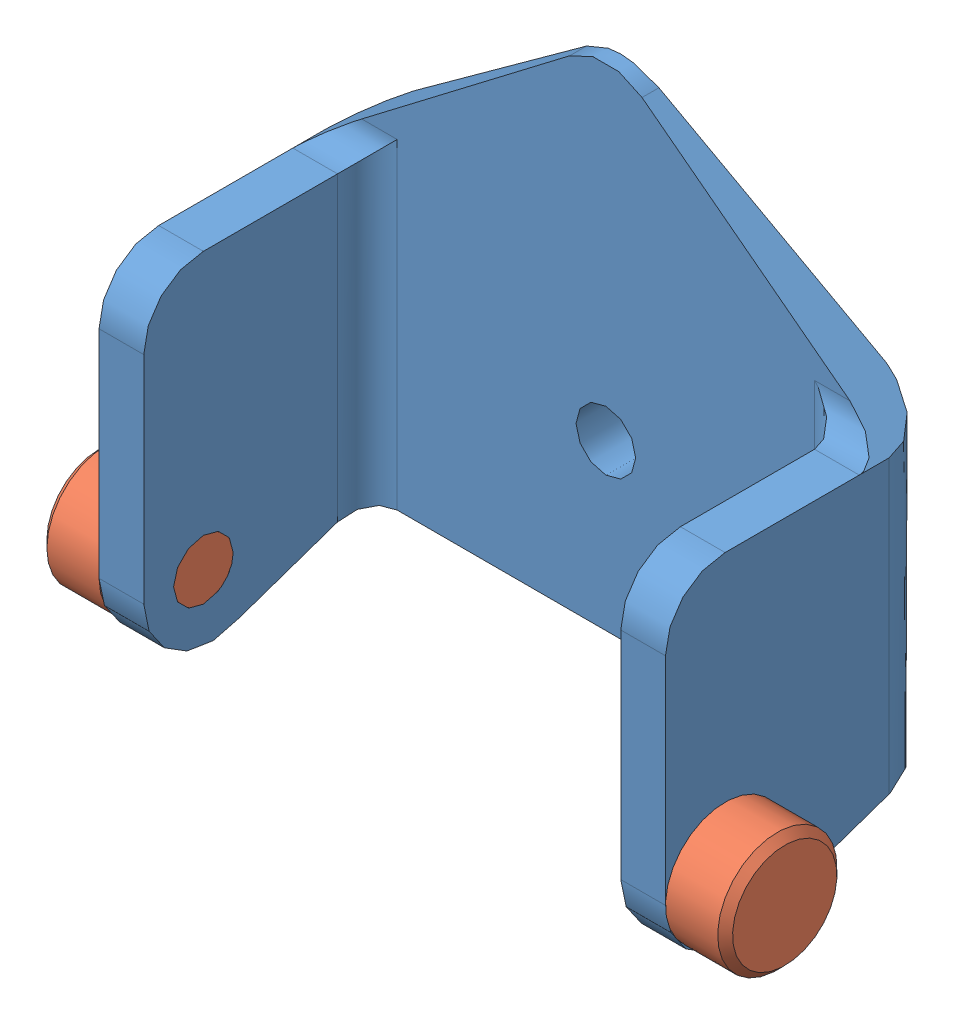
SolidWorks assembly Assemblage1.sldasm, configuration Défaut (file format 4100). Lengths in mm.
Overall size (46 37.19 19.22).
3 component instances, 2 part files, 4 mates.
Components (placement in the parent):
- Basculeur 10-1: Basculeur 10.SLDPRT [Défaut] at (-1.5238 -1.4873 -6) size (38 36.42 18)
- Axe 11-2: Axe 11.SLDPRT [Défaut] at (-24.5238 -11.4873 5) size (7 8 8)
- Axe 11-3: Axe 11.SLDPRT [Défaut] at (21.4762 -11.4873 5) x (-1 0 0) z (0 -0.924225 -0.381849) size (7 8 8)
Mates (geometry in assembly coordinates):
- Coïncidente1: coincident anti-aligned: plane of Basculeur 10-1 through (-20.5238 -11.4873 -9) normal (-1 0 0); plane of Axe 11-2 through (-20.5238 -7.4873 5) normal (1 0 0)
- Coaxiale1: concentric aligned: cylinder of Basculeur 10-1 through (-17.5238 -11.4873 5) axis (-1 0 0) radius 2; cylinder of Axe 11-2 through (-41.6799 -11.4873 5) axis (-1 0 0) radius 2
- Coïncidente2: coincident anti-aligned: plane of Axe 11-3 through (17.4762 -9.9599 1.3031) normal (-1 0 0); plane of Basculeur 10-1 through (17.4762 -11.4873 -9) normal (1 0 0)
- Coaxiale2: concentric aligned: cylinder of Basculeur 10-1 through (14.4762 -11.4873 5) axis (1 0 0) radius 2; cylinder of Axe 11-3 through (38.6324 -11.4873 5) axis (1 0 0) radius 2
